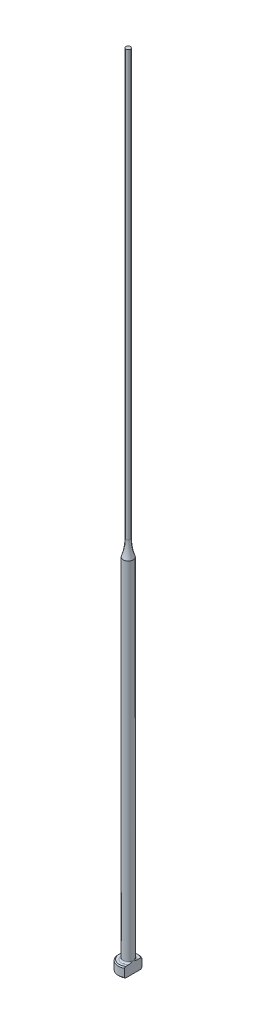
ISO-10303-21;
HEADER;
FILE_DESCRIPTION(('STEP AP214'),'2;1');
FILE_NAME('part.step','',(''),(''),'','','');
FILE_SCHEMA(('AUTOMOTIVE_DESIGN { 1 0 10303 214 1 1 1 1 }'));
ENDSEC;
DATA;
#1=APPLICATION_CONTEXT('core data for automotive mechanical design processes');
#2=APPLICATION_PROTOCOL_DEFINITION('international standard','automotive_design',2000,#1);
#3=PRODUCT_CONTEXT('',#1,'mechanical');
#4=PRODUCT('Part','Part','',(#3));
#5=PRODUCT_RELATED_PRODUCT_CATEGORY('part','',(#4));
#6=PRODUCT_DEFINITION_FORMATION('','',#4);
#7=PRODUCT_DEFINITION_CONTEXT('part definition',#1,'design');
#8=PRODUCT_DEFINITION('design','',#6,#7);
#9=PRODUCT_DEFINITION_SHAPE('','',#8);
#10=(LENGTH_UNIT() NAMED_UNIT(*) SI_UNIT(.MILLI.,.METRE.));
#11=(NAMED_UNIT(*) PLANE_ANGLE_UNIT() SI_UNIT($,.RADIAN.));
#12=(NAMED_UNIT(*) SI_UNIT($,.STERADIAN.) SOLID_ANGLE_UNIT());
#13=UNCERTAINTY_MEASURE_WITH_UNIT(LENGTH_MEASURE(1.E-05),#10,'distance_accuracy_value','');
#14=(GEOMETRIC_REPRESENTATION_CONTEXT(3) GLOBAL_UNCERTAINTY_ASSIGNED_CONTEXT((#13)) GLOBAL_UNIT_ASSIGNED_CONTEXT((#10,
#11,#12)) REPRESENTATION_CONTEXT('',''));
#15=CARTESIAN_POINT('',(0.,0.,0.));
#16=DIRECTION('',(0.,0.,1.));
#17=DIRECTION('',(1.,0.,0.));
#18=AXIS2_PLACEMENT_3D('',#15,#16,#17);
#19=CARTESIAN_POINT('',(-1.99999999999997,2.,0.));
#20=DIRECTION('',(0.,1.,0.));
#21=DIRECTION('',(0.,0.,1.));
#22=AXIS2_PLACEMENT_3D('',#19,#20,#21);
#23=PLANE('',#22);
#24=CARTESIAN_POINT('',(0.,2.,0.));
#25=DIRECTION('',(0.,1.,0.));
#26=DIRECTION('',(0.,0.,1.));
#27=AXIS2_PLACEMENT_3D('',#24,#25,#26);
#28=CIRCLE('',#27,1.79999999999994);
#29=CARTESIAN_POINT('',(0.999999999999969,2.,-1.49666295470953));
#30=VERTEX_POINT('',#29);
#31=CARTESIAN_POINT('',(0.999999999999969,2.,1.49666295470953));
#32=VERTEX_POINT('',#31);
#33=EDGE_CURVE('E187',#30,#32,#28,.T.);
#34=ORIENTED_EDGE('',*,*,#33,.T.);
#35=DIRECTION('',(0.,0.,-1.));
#36=VECTOR('',#35,1.);
#37=CARTESIAN_POINT('',(0.999999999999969,2.,0.));
#38=LINE('',#37,#36);
#39=CARTESIAN_POINT('',(0.999999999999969,2.00000000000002,0.830662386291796));
#40=VERTEX_POINT('',#39);
#41=EDGE_CURVE('E57',#32,#40,#38,.T.);
#42=ORIENTED_EDGE('',*,*,#41,.T.);
#43=CARTESIAN_POINT('',(0.,2.,0.));
#44=DIRECTION('',(0.,1.,0.));
#45=DIRECTION('',(0.,0.,1.));
#46=AXIS2_PLACEMENT_3D('',#43,#44,#45);
#47=CIRCLE('',#46,1.29999999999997);
#48=CARTESIAN_POINT('',(0.999999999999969,2.00000000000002,-0.830662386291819));
#49=VERTEX_POINT('',#48);
#50=EDGE_CURVE('E108',#40,#49,#47,.F.);
#51=ORIENTED_EDGE('',*,*,#50,.T.);
#52=EDGE_CURVE('E137',#49,#30,#38,.T.);
#53=ORIENTED_EDGE('',*,*,#52,.T.);
#54=EDGE_LOOP('',(#34,#42,#51,#53));
#55=FACE_BOUND('',#54,.T.);
#56=ADVANCED_FACE('F32',(#55),#23,.T.);
#57=CARTESIAN_POINT('',(0.,259.958771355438,0.));
#58=DIRECTION('',(0.,1.,0.));
#59=DIRECTION('',(0.,0.,1.));
#60=AXIS2_PLACEMENT_3D('',#57,#58,#59);
#61=CYLINDRICAL_SURFACE('',#60,1.99999999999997);
#62=CARTESIAN_POINT('',(0.,1.79999999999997,0.));
#63=DIRECTION('',(0.,1.,0.));
#64=DIRECTION('',(0.,0.,1.));
#65=AXIS2_PLACEMENT_3D('',#62,#63,#64);
#66=CIRCLE('',#65,1.99999999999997);
#67=CARTESIAN_POINT('',(0.999999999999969,1.79999999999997,1.73205080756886));
#68=VERTEX_POINT('',#67);
#69=CARTESIAN_POINT('',(0.999999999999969,1.79999999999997,-1.73205080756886));
#70=VERTEX_POINT('',#69);
#71=EDGE_CURVE('E105',#68,#70,#66,.F.);
#72=ORIENTED_EDGE('',*,*,#71,.T.);
#73=DIRECTION('',(0.,-1.,0.));
#74=VECTOR('',#73,1.);
#75=CARTESIAN_POINT('',(0.999999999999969,160.,-1.73205080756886));
#76=LINE('',#75,#74);
#77=CARTESIAN_POINT('',(0.999999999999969,0.199999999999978,-1.73205080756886));
#78=VERTEX_POINT('',#77);
#79=EDGE_CURVE('E193',#70,#78,#76,.T.);
#80=ORIENTED_EDGE('',*,*,#79,.T.);
#81=CARTESIAN_POINT('',(0.,0.199999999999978,0.));
#82=DIRECTION('',(0.,-1.,0.));
#83=DIRECTION('',(0.,0.,-1.));
#84=AXIS2_PLACEMENT_3D('',#81,#82,#83);
#85=CIRCLE('',#84,1.99999999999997);
#86=CARTESIAN_POINT('',(0.999999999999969,0.199999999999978,1.73205080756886));
#87=VERTEX_POINT('',#86);
#88=EDGE_CURVE('E100',#78,#87,#85,.F.);
#89=ORIENTED_EDGE('',*,*,#88,.T.);
#90=DIRECTION('',(0.,-1.,0.));
#91=VECTOR('',#90,1.);
#92=CARTESIAN_POINT('',(0.999999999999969,160.,1.73205080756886));
#93=LINE('',#92,#91);
#94=EDGE_CURVE('E93',#68,#87,#93,.T.);
#95=ORIENTED_EDGE('',*,*,#94,.F.);
#96=EDGE_LOOP('',(#72,#80,#89,#95));
#97=FACE_BOUND('',#96,.T.);
#98=ADVANCED_FACE('F158',(#97),#61,.T.);
#99=CARTESIAN_POINT('',(0.,0.,0.));
#100=DIRECTION('',(0.,-1.,0.));
#101=DIRECTION('',(0.,0.,-1.));
#102=AXIS2_PLACEMENT_3D('',#99,#100,#101);
#103=PLANE('',#102);
#104=CARTESIAN_POINT('',(0.,0.,0.));
#105=DIRECTION('',(0.,-1.,0.));
#106=DIRECTION('',(0.,0.,-1.));
#107=AXIS2_PLACEMENT_3D('',#104,#105,#106);
#108=CIRCLE('',#107,1.79999999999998);
#109=CARTESIAN_POINT('',(0.999999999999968,0.,1.49666295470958));
#110=VERTEX_POINT('',#109);
#111=CARTESIAN_POINT('',(0.999999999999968,0.,-1.49666295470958));
#112=VERTEX_POINT('',#111);
#113=EDGE_CURVE('E98',#110,#112,#108,.T.);
#114=ORIENTED_EDGE('',*,*,#113,.T.);
#115=DIRECTION('',(0.,0.,1.));
#116=VECTOR('',#115,1.);
#117=CARTESIAN_POINT('',(0.999999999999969,0.,-1.73205080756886));
#118=LINE('',#117,#116);
#119=EDGE_CURVE('E83',#112,#110,#118,.T.);
#120=ORIENTED_EDGE('',*,*,#119,.T.);
#121=EDGE_LOOP('',(#114,#120));
#122=FACE_BOUND('',#121,.T.);
#123=ADVANCED_FACE('F103',(#122),#103,.T.);
#124=CARTESIAN_POINT('',(0.,2.,0.));
#125=DIRECTION('',(0.,-1.,0.));
#126=DIRECTION('',(0.,0.,-1.));
#127=AXIS2_PLACEMENT_3D('',#124,#125,#126);
#128=CONICAL_SURFACE('',#127,1.79999999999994,0.785398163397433);
#129=ORIENTED_EDGE('',*,*,#71,.F.);
#130=CARTESIAN_POINT('',(0.999999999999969,-0.143084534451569,3.81417299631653));
#131=CARTESIAN_POINT('',(0.999999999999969,-0.0593997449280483,3.72765647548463));
#132=CARTESIAN_POINT('',(0.999999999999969,0.0241940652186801,3.64105173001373));
#133=CARTESIAN_POINT('',(0.999999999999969,0.191148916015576,3.46761616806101));
#134=CARTESIAN_POINT('',(0.999999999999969,0.274509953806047,3.3807853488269));
#135=CARTESIAN_POINT('',(0.999999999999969,0.524249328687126,3.11979400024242));
#136=CARTESIAN_POINT('',(0.999999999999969,0.690198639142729,2.94522254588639));
#137=CARTESIAN_POINT('',(0.999999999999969,1.01697550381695,2.59782670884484));
#138=CARTESIAN_POINT('',(0.999999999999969,1.17783928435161,2.42503661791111));
#139=CARTESIAN_POINT('',(0.999999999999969,1.41669118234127,2.16364984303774));
#140=CARTESIAN_POINT('',(0.999999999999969,1.49589273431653,2.07616357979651));
#141=CARTESIAN_POINT('',(0.999999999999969,1.65313803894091,1.90015721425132));
#142=CARTESIAN_POINT('',(0.999999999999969,1.73118183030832,1.81163714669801));
#143=CARTESIAN_POINT('',(0.999999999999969,1.85567318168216,1.66767927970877));
#144=CARTESIAN_POINT('',(0.999999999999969,1.90265415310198,1.61270332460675));
#145=CARTESIAN_POINT('',(0.999999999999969,1.99577882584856,1.50203557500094));
#146=CARTESIAN_POINT('',(0.999999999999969,2.04192244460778,1.44634371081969));
#147=CARTESIAN_POINT('',(0.999999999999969,2.13356596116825,1.33345480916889));
#148=CARTESIAN_POINT('',(0.999999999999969,2.17905399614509,1.2762481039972));
#149=CARTESIAN_POINT('',(0.999999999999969,2.26844283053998,1.16060976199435));
#150=CARTESIAN_POINT('',(0.999999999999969,2.3123437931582,1.10217825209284));
#151=CARTESIAN_POINT('',(0.999999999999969,2.39853453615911,0.982773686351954));
#152=CARTESIAN_POINT('',(0.999999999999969,2.44078986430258,0.921775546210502));
#153=CARTESIAN_POINT('',(0.999999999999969,2.52187810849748,0.797387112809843));
#154=CARTESIAN_POINT('',(0.999999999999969,2.56070631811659,0.733993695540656));
#155=CARTESIAN_POINT('',(0.999999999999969,2.6324859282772,0.604932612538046));
#156=CARTESIAN_POINT('',(0.999999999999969,2.66550424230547,0.539302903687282));
#157=CARTESIAN_POINT('',(0.999999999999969,2.72301550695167,0.404437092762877));
#158=CARTESIAN_POINT('',(0.999999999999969,2.74753707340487,0.335214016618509));
#159=CARTESIAN_POINT('',(0.999999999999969,2.77407110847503,0.231400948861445));
#160=CARTESIAN_POINT('',(0.999999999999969,2.78110742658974,0.198093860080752));
#161=CARTESIAN_POINT('',(0.999999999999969,2.79200506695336,0.130954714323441));
#162=CARTESIAN_POINT('',(0.999999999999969,2.7958666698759,0.0971227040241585));
#163=CARTESIAN_POINT('',(0.999999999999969,2.80013905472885,0.0293410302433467));
#164=CARTESIAN_POINT('',(0.999999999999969,2.80056046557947,-0.00460794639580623));
#165=CARTESIAN_POINT('',(0.999999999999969,2.79795882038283,-0.0723663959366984));
#166=CARTESIAN_POINT('',(0.999999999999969,2.79493547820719,-0.106175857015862));
#167=CARTESIAN_POINT('',(0.999999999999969,2.78105481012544,-0.206326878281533));
#168=CARTESIAN_POINT('',(0.999999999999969,2.76542146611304,-0.272037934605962));
#169=CARTESIAN_POINT('',(0.999999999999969,2.73477554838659,-0.368312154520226));
#170=CARTESIAN_POINT('',(0.999999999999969,2.72331063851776,-0.40012349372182));
#171=CARTESIAN_POINT('',(0.999999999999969,2.69840546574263,-0.46296441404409));
#172=CARTESIAN_POINT('',(0.999999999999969,2.68496560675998,-0.493994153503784));
#173=CARTESIAN_POINT('',(0.999999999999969,2.64209309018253,-0.586298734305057));
#174=CARTESIAN_POINT('',(0.999999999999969,2.61022871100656,-0.64643570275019));
#175=CARTESIAN_POINT('',(0.999999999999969,2.5422853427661,-0.764304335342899));
#176=CARTESIAN_POINT('',(0.999999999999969,2.50620119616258,-0.822032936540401));
#177=CARTESIAN_POINT('',(0.999999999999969,2.43107084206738,-0.935840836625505));
#178=CARTESIAN_POINT('',(0.999999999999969,2.39201347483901,-0.991912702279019));
#179=CARTESIAN_POINT('',(0.999999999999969,2.31195870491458,-1.10259849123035));
#180=CARTESIAN_POINT('',(0.999999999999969,2.27096226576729,-1.15721311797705));
#181=CARTESIAN_POINT('',(0.999999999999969,2.18701695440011,-1.26606869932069));
#182=CARTESIAN_POINT('',(0.999999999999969,2.14404946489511,-1.32029522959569));
#183=CARTESIAN_POINT('',(0.999999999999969,2.0570505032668,-1.4278898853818));
#184=CARTESIAN_POINT('',(0.999999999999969,2.01301896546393,-1.48125795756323));
#185=CARTESIAN_POINT('',(0.999999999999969,1.87995068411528,-1.64010952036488));
#186=CARTESIAN_POINT('',(0.999999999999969,1.78973357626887,-1.74460261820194));
#187=CARTESIAN_POINT('',(0.999999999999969,1.62290341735,-1.93426834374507));
#188=CARTESIAN_POINT('',(0.999999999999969,1.54658658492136,-2.01970404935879));
#189=CARTESIAN_POINT('',(0.999999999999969,1.39301250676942,-2.18973019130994));
#190=CARTESIAN_POINT('',(0.999999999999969,1.31575523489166,-2.27432060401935));
#191=CARTESIAN_POINT('',(0.999999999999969,1.08283440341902,-2.52732479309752));
#192=CARTESIAN_POINT('',(0.999999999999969,0.926165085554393,-2.69481086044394));
#193=CARTESIAN_POINT('',(0.999999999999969,0.617772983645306,-3.02147252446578));
#194=CARTESIAN_POINT('',(0.999999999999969,0.466111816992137,-3.18070657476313));
#195=CARTESIAN_POINT('',(0.999999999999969,0.238015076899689,-3.41880818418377));
#196=CARTESIAN_POINT('',(0.999999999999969,0.1619245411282,-3.49800657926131));
#197=CARTESIAN_POINT('',(0.999999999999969,0.00955322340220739,-3.65621892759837));
#198=CARTESIAN_POINT('',(0.999999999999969,-0.0667275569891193,-3.73523288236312));
#199=CARTESIAN_POINT('',(0.999999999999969,-0.14308453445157,-3.81417299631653));
#200=B_SPLINE_CURVE_WITH_KNOTS('',3,(#130,#131,#132,#133,#134,#135,#136,#137,#138,#139,#140,
#141,#142,#143,#144,#145,#146,#147,#148,#149,#150,#151,#152,#153,#154,#155,#156,#157,#158,#159,
#160,#161,#162,#163,#164,#165,#166,#167,#168,#169,#170,#171,#172,#173,#174,#175,#176,#177,#178,
#179,#180,#181,#182,#183,#184,#185,#186,#187,#188,#189,#190,#191,#192,#193,#194,#195,#196,#197,
#198,#199),.UNSPECIFIED.,.F.,.F.,(4,2,2,2,2,2,2,2,2,2,2,2,2,2,2,2,2,2,2,2,2,2,2,2,2,2,2,2,2,2,2,
2,2,2,4),(0.,0.36110162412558,0.722207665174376,1.44478731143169,2.15299784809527,
2.5070263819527,2.8610430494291,3.07798416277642,3.29494655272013,3.51418925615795,
3.73340935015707,3.95594813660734,4.17878792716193,4.39886399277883,4.61819150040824,
4.72018864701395,4.82217677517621,4.92384967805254,5.02553102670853,5.22698459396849,
5.32838854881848,5.4297717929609,5.63365200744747,5.837784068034,6.04272417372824,
6.24756349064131,6.45510395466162,6.66265726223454,7.07676259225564,7.42043039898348,
7.76410778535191,8.45210822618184,9.11180822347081,9.44129145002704,9.77077197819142),.UNSPECIFIED.);
#201=EDGE_CURVE('E136',#68,#32,#200,.T.);
#202=ORIENTED_EDGE('',*,*,#201,.T.);
#203=ORIENTED_EDGE('',*,*,#33,.F.);
#204=EDGE_CURVE('E128',#30,#70,#200,.T.);
#205=ORIENTED_EDGE('',*,*,#204,.T.);
#206=EDGE_LOOP('',(#129,#202,#203,#205));
#207=FACE_BOUND('',#206,.T.);
#208=ADVANCED_FACE('F144',(#207),#128,.T.);
#209=CARTESIAN_POINT('',(0.,0.199999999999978,0.));
#210=DIRECTION('',(0.,1.,0.));
#211=DIRECTION('',(0.,0.,1.));
#212=AXIS2_PLACEMENT_3D('',#209,#210,#211);
#213=CONICAL_SURFACE('',#212,1.99999999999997,0.785398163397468);
#214=ORIENTED_EDGE('',*,*,#88,.F.);
#215=CARTESIAN_POINT('',(0.999999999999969,2.14308453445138,-3.81417299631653));
#216=CARTESIAN_POINT('',(0.999999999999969,2.05939974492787,-3.72765647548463));
#217=CARTESIAN_POINT('',(0.999999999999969,1.97580593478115,-3.64105173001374));
#218=CARTESIAN_POINT('',(0.999999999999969,1.80885108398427,-3.46761616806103));
#219=CARTESIAN_POINT('',(0.999999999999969,1.72549004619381,-3.38078534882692));
#220=CARTESIAN_POINT('',(0.999999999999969,1.47575067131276,-3.11979400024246));
#221=CARTESIAN_POINT('',(0.999999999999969,1.30980136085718,-2.94522254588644));
#222=CARTESIAN_POINT('',(0.999999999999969,0.983024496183,-2.5978267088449));
#223=CARTESIAN_POINT('',(0.999999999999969,0.822160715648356,-2.42503661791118));
#224=CARTESIAN_POINT('',(0.999999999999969,0.583308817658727,-2.16364984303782));
#225=CARTESIAN_POINT('',(0.999999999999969,0.50410726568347,-2.0761635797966));
#226=CARTESIAN_POINT('',(0.999999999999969,0.346861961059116,-1.90015721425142));
#227=CARTESIAN_POINT('',(0.999999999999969,0.26881816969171,-1.81163714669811));
#228=CARTESIAN_POINT('',(0.999999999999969,0.144326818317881,-1.66767927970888));
#229=CARTESIAN_POINT('',(0.999999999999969,0.0973458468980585,-1.61270332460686));
#230=CARTESIAN_POINT('',(0.999999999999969,0.00422117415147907,-1.50203557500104));
#231=CARTESIAN_POINT('',(0.999999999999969,-0.0419224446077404,-1.44634371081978));
#232=CARTESIAN_POINT('',(0.999999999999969,-0.133565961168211,-1.33345480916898));
#233=CARTESIAN_POINT('',(0.999999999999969,-0.179053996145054,-1.27624810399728));
#234=CARTESIAN_POINT('',(0.999999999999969,-0.268442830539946,-1.16060976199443));
#235=CARTESIAN_POINT('',(0.999999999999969,-0.31234379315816,-1.10217825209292));
#236=CARTESIAN_POINT('',(0.999999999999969,-0.398534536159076,-0.982773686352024));
#237=CARTESIAN_POINT('',(0.999999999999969,-0.440789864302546,-0.92177554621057));
#238=CARTESIAN_POINT('',(0.999999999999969,-0.521878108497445,-0.797387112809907));
#239=CARTESIAN_POINT('',(0.999999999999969,-0.560706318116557,-0.733993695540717));
#240=CARTESIAN_POINT('',(0.999999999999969,-0.632485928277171,-0.604932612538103));
#241=CARTESIAN_POINT('',(0.999999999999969,-0.665504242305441,-0.539302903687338));
#242=CARTESIAN_POINT('',(0.999999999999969,-0.723015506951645,-0.404437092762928));
#243=CARTESIAN_POINT('',(0.999999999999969,-0.747537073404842,-0.335214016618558));
#244=CARTESIAN_POINT('',(0.999999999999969,-0.774071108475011,-0.231400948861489));
#245=CARTESIAN_POINT('',(0.999999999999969,-0.781107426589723,-0.198093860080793));
#246=CARTESIAN_POINT('',(0.999999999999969,-0.792005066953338,-0.130954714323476));
#247=CARTESIAN_POINT('',(0.999999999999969,-0.795866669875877,-0.0971227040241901));
#248=CARTESIAN_POINT('',(0.999999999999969,-0.800139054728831,-0.0293410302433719));
#249=CARTESIAN_POINT('',(0.999999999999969,-0.80056046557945,0.00460794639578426));
#250=CARTESIAN_POINT('',(0.999999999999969,-0.797958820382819,0.0723663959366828));
#251=CARTESIAN_POINT('',(0.999999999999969,-0.794935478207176,0.106175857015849));
#252=CARTESIAN_POINT('',(0.999999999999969,-0.781054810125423,0.20632687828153));
#253=CARTESIAN_POINT('',(0.999999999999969,-0.765421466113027,0.272037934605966));
#254=CARTESIAN_POINT('',(0.999999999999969,-0.734775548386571,0.36831215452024));
#255=CARTESIAN_POINT('',(0.999999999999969,-0.723310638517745,0.400123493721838));
#256=CARTESIAN_POINT('',(0.999999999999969,-0.698405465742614,0.462964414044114));
#257=CARTESIAN_POINT('',(0.999999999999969,-0.684965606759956,0.493994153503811));
#258=CARTESIAN_POINT('',(0.999999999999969,-0.642093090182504,0.586298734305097));
#259=CARTESIAN_POINT('',(0.999999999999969,-0.610228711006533,0.646435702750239));
#260=CARTESIAN_POINT('',(0.999999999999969,-0.542285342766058,0.764304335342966));
#261=CARTESIAN_POINT('',(0.999999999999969,-0.506201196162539,0.822032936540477));
#262=CARTESIAN_POINT('',(0.999999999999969,-0.431070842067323,0.935840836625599));
#263=CARTESIAN_POINT('',(0.999999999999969,-0.392013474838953,0.991912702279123));
#264=CARTESIAN_POINT('',(0.999999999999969,-0.311958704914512,1.10259849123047));
#265=CARTESIAN_POINT('',(0.999999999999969,-0.270962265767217,1.15721311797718));
#266=CARTESIAN_POINT('',(0.999999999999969,-0.187016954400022,1.26606869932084));
#267=CARTESIAN_POINT('',(0.999999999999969,-0.144049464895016,1.32029522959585));
#268=CARTESIAN_POINT('',(0.999999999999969,-0.0570505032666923,1.42788988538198));
#269=CARTESIAN_POINT('',(0.999999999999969,-0.0130189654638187,1.48125795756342));
#270=CARTESIAN_POINT('',(0.999999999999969,0.120049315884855,1.64010952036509));
#271=CARTESIAN_POINT('',(0.999999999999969,0.21026642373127,1.74460261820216));
#272=CARTESIAN_POINT('',(0.999999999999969,0.37709658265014,1.9342683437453));
#273=CARTESIAN_POINT('',(0.999999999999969,0.453413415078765,2.01970404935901));
#274=CARTESIAN_POINT('',(0.999999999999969,0.606987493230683,2.18973019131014));
#275=CARTESIAN_POINT('',(0.999999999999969,0.684244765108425,2.27432060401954));
#276=CARTESIAN_POINT('',(0.999999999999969,0.917165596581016,2.52732479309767));
#277=CARTESIAN_POINT('',(0.999999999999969,1.07383491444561,2.69481086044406));
#278=CARTESIAN_POINT('',(0.999999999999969,1.38222701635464,3.02147252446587));
#279=CARTESIAN_POINT('',(0.999999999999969,1.53388818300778,3.1807065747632));
#280=CARTESIAN_POINT('',(0.999999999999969,1.76198492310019,3.41880818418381));
#281=CARTESIAN_POINT('',(0.999999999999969,1.83807545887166,3.49800657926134));
#282=CARTESIAN_POINT('',(0.999999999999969,1.99044677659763,3.65621892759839));
#283=CARTESIAN_POINT('',(0.999999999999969,2.06672755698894,3.73523288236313));
#284=CARTESIAN_POINT('',(0.999999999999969,2.14308453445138,3.81417299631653));
#285=B_SPLINE_CURVE_WITH_KNOTS('',3,(#215,#216,#217,#218,#219,#220,#221,#222,#223,#224,#225,
#226,#227,#228,#229,#230,#231,#232,#233,#234,#235,#236,#237,#238,#239,#240,#241,#242,#243,#244,
#245,#246,#247,#248,#249,#250,#251,#252,#253,#254,#255,#256,#257,#258,#259,#260,#261,#262,#263,
#264,#265,#266,#267,#268,#269,#270,#271,#272,#273,#274,#275,#276,#277,#278,#279,#280,#281,#282,
#283,#284),.UNSPECIFIED.,.F.,.F.,(4,2,2,2,2,2,2,2,2,2,2,2,2,2,2,2,2,2,2,2,2,2,2,2,2,2,2,2,2,2,2,
2,2,2,4),(0.,0.36110162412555,0.722207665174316,1.44478731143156,2.15299784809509,
2.5070263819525,2.86104304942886,3.07798416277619,3.2949465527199,3.51418925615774,
3.73340935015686,3.95594813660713,4.17878792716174,4.39886399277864,4.61819150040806,
4.72018864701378,4.82217677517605,4.92384967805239,5.02553102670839,5.22698459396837,
5.32838854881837,5.4297717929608,5.6336520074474,5.83778406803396,6.04272417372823,
6.24756349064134,6.45510395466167,6.66265726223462,7.07676259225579,7.42043039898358,
7.76410778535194,8.45210822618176,9.11180822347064,9.44129145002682,9.77077197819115),.UNSPECIFIED.);
#286=EDGE_CURVE('E86',#78,#112,#285,.T.);
#287=ORIENTED_EDGE('',*,*,#286,.T.);
#288=ORIENTED_EDGE('',*,*,#113,.F.);
#289=EDGE_CURVE('E89',#110,#87,#285,.T.);
#290=ORIENTED_EDGE('',*,*,#289,.T.);
#291=EDGE_LOOP('',(#214,#287,#288,#290));
#292=FACE_BOUND('',#291,.T.);
#293=ADVANCED_FACE('F97',(#292),#213,.T.);
#294=CARTESIAN_POINT('',(0.,2.30000000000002,0.));
#295=DIRECTION('',(0.,1.,0.));
#296=DIRECTION('',(0.,0.,1.));
#297=AXIS2_PLACEMENT_3D('',#294,#295,#296);
#298=TOROIDAL_SURFACE('',#297,1.29999999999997,0.3);
#299=CARTESIAN_POINT('',(0.999999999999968,2.30000000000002,0.));
#300=CARTESIAN_POINT('',(0.999999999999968,2.30000064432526,8.6574445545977E-12));
#301=CARTESIAN_POINT('',(0.999999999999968,2.30000128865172,-9.05742231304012E-08));
#302=CARTESIAN_POINT('',(0.999999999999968,2.30000254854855,-3.98319620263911E-07));
#303=CARTESIAN_POINT('',(0.999999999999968,2.30000316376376,-6.16748313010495E-07));
#304=CARTESIAN_POINT('',(0.999999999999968,2.30000438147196,-1.15047367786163E-06));
#305=CARTESIAN_POINT('',(0.999999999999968,2.30000498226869,-1.46954564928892E-06));
#306=CARTESIAN_POINT('',(0.999999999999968,2.30000613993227,-2.17388585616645E-06));
#307=CARTESIAN_POINT('',(0.999999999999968,2.3000066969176,-2.55896592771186E-06));
#308=CARTESIAN_POINT('',(0.999999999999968,2.30000847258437,-3.89137454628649E-06));
#309=CARTESIAN_POINT('',(0.999999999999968,2.30000962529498,-4.9272569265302E-06));
#310=CARTESIAN_POINT('',(0.999999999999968,2.30001175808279,-7.12255376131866E-06));
#311=CARTESIAN_POINT('',(0.999999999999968,2.30001274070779,-8.27963246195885E-06));
#312=CARTESIAN_POINT('',(0.999999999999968,2.30001619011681,-1.25710396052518E-05));
#313=CARTESIAN_POINT('',(0.999999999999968,2.30001847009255,-1.58589994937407E-05));
#314=CARTESIAN_POINT('',(0.999999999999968,2.3000224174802,-2.25210462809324E-05));
#315=CARTESIAN_POINT('',(0.999999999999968,2.30002411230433,-2.58796667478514E-05));
#316=CARTESIAN_POINT('',(0.999999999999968,2.30003085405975,-3.94941957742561E-05));
#317=CARTESIAN_POINT('',(0.999999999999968,2.30003568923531,-4.98493079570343E-05));
#318=CARTESIAN_POINT('',(0.999999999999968,2.30004388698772,-6.96407730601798E-05));
#319=CARTESIAN_POINT('',(0.999999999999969,2.30004735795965,-7.903098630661E-05));
#320=CARTESIAN_POINT('',(0.999999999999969,2.30007348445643,-0.000144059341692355));
#321=CARTESIAN_POINT('',(0.999999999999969,2.30010510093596,-0.000195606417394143));
#322=CARTESIAN_POINT('',(0.999999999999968,2.30022061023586,-0.000391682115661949));
#323=CARTESIAN_POINT('',(0.999999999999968,2.3002978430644,-0.000539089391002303));
#324=CARTESIAN_POINT('',(0.999999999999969,2.30059433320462,-0.00109591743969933));
#325=CARTESIAN_POINT('',(0.999999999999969,2.30082052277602,-0.00150237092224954));
#326=CARTESIAN_POINT('',(0.999999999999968,2.30171558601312,-0.00311941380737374));
#327=CARTESIAN_POINT('',(0.999999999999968,2.30237677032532,-0.00433326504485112));
#328=CARTESIAN_POINT('',(0.999999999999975,2.31602135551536,-0.0293725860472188));
#329=CARTESIAN_POINT('',(0.99999999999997,2.32909104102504,-0.0531623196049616));
#330=CARTESIAN_POINT('',(0.999999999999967,2.35458080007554,-0.100088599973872));
#331=CARTESIAN_POINT('',(0.999999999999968,2.36700820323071,-0.123221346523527));
#332=CARTESIAN_POINT('',(0.999999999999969,2.39281545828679,-0.172044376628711));
#333=CARTESIAN_POINT('',(0.999999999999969,2.4061616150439,-0.197752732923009));
#334=CARTESIAN_POINT('',(0.999999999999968,2.4323541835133,-0.249714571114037));
#335=CARTESIAN_POINT('',(0.999999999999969,2.44519503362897,-0.27597087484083));
#336=CARTESIAN_POINT('',(0.999999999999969,2.46718175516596,-0.322864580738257));
#337=CARTESIAN_POINT('',(0.999999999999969,2.47650292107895,-0.34341923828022));
#338=CARTESIAN_POINT('',(0.999999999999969,2.49448113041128,-0.384761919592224));
#339=CARTESIAN_POINT('',(0.999999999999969,2.50313958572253,-0.405549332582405));
#340=CARTESIAN_POINT('',(0.999999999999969,2.5276434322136,-0.467585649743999));
#341=CARTESIAN_POINT('',(0.999999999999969,2.54239224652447,-0.509286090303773));
#342=CARTESIAN_POINT('',(0.999999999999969,2.56458900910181,-0.58349816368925));
#343=CARTESIAN_POINT('',(0.999999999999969,2.57294045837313,-0.61573699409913));
#344=CARTESIAN_POINT('',(0.999999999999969,2.58691787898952,-0.682155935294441));
#345=CARTESIAN_POINT('',(0.999999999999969,2.5924232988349,-0.716362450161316));
#346=CARTESIAN_POINT('',(0.999999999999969,2.59932200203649,-0.784996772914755));
#347=CARTESIAN_POINT('',(0.999999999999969,2.60074119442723,-0.819421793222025));
#348=CARTESIAN_POINT('',(0.999999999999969,2.59853032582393,-0.88779225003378));
#349=CARTESIAN_POINT('',(0.999999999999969,2.59495737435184,-0.921738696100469));
#350=CARTESIAN_POINT('',(0.999999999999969,2.58381038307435,-0.977927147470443));
#351=CARTESIAN_POINT('',(0.999999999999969,2.57785171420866,-1.00048693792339));
#352=CARTESIAN_POINT('',(0.999999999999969,2.56267132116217,-1.0445512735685));
#353=CARTESIAN_POINT('',(0.999999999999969,2.55344592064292,-1.06605459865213));
#354=CARTESIAN_POINT('',(0.999999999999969,2.53348156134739,-1.10327564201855));
#355=CARTESIAN_POINT('',(0.999999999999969,2.52335553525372,-1.11931996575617));
#356=CARTESIAN_POINT('',(0.999999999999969,2.50063930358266,-1.1495565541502));
#357=CARTESIAN_POINT('',(0.999999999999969,2.48805327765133,-1.16375189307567));
#358=CARTESIAN_POINT('',(0.999999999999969,2.46313284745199,-1.18709127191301));
#359=CARTESIAN_POINT('',(0.999999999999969,2.45121755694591,-1.19668155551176));
#360=CARTESIAN_POINT('',(0.999999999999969,2.4259612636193,-1.21377371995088));
#361=CARTESIAN_POINT('',(0.999999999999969,2.41262072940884,-1.2212762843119));
#362=CARTESIAN_POINT('',(0.999999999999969,2.38471163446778,-1.23381879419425));
#363=CARTESIAN_POINT('',(0.999999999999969,2.3701356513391,-1.23884240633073));
#364=CARTESIAN_POINT('',(0.999999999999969,2.34029120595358,-1.2460136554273));
#365=CARTESIAN_POINT('',(0.999999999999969,2.32502317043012,-1.24816304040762));
#366=CARTESIAN_POINT('',(0.999999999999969,2.29609418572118,-1.24936303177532));
#367=CARTESIAN_POINT('',(0.999999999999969,2.28244572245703,-1.24873511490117));
#368=CARTESIAN_POINT('',(0.999999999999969,2.25546467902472,-1.24513625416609));
#369=CARTESIAN_POINT('',(0.999999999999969,2.2421320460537,-1.24216570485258));
#370=CARTESIAN_POINT('',(0.999999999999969,2.21644742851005,-1.23414136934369));
#371=CARTESIAN_POINT('',(0.999999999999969,2.20408009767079,-1.22913614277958));
#372=CARTESIAN_POINT('',(0.999999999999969,2.18026539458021,-1.2172891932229));
#373=CARTESIAN_POINT('',(0.999999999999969,2.16881815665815,-1.21044720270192));
#374=CARTESIAN_POINT('',(0.999999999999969,2.14602713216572,-1.19450929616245));
#375=CARTESIAN_POINT('',(0.999999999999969,2.1347876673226,-1.18526487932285));
#376=CARTESIAN_POINT('',(0.999999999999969,2.11372805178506,-1.16528066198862));
#377=CARTESIAN_POINT('',(0.999999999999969,2.1039092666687,-1.15453944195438));
#378=CARTESIAN_POINT('',(0.999999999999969,2.08131380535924,-1.12639326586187));
#379=CARTESIAN_POINT('',(0.999999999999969,2.06941227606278,-1.10828305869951));
#380=CARTESIAN_POINT('',(0.999999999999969,2.04871157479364,-1.07041295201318));
#381=CARTESIAN_POINT('',(0.999999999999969,2.03991325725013,-1.05065259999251));
#382=CARTESIAN_POINT('',(0.999999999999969,2.02219264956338,-1.00203188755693));
#383=CARTESIAN_POINT('',(0.999999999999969,2.01461756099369,-0.972682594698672));
#384=CARTESIAN_POINT('',(0.999999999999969,2.00410660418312,-0.912914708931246));
#385=CARTESIAN_POINT('',(0.999999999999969,2.00122174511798,-0.882487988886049));
#386=CARTESIAN_POINT('',(0.999999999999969,1.99886242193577,-0.80318909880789));
#387=CARTESIAN_POINT('',(0.999999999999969,2.0024814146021,-0.754226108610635));
#388=CARTESIAN_POINT('',(0.999999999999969,2.01327071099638,-0.682724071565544));
#389=CARTESIAN_POINT('',(0.999999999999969,2.01762186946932,-0.659663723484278));
#390=CARTESIAN_POINT('',(0.999999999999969,2.02775671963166,-0.613959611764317));
#391=CARTESIAN_POINT('',(0.999999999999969,2.03353398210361,-0.59131445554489));
#392=CARTESIAN_POINT('',(0.999999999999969,2.05232003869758,-0.525222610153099));
#393=CARTESIAN_POINT('',(0.999999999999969,2.0670175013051,-0.482256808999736));
#394=CARTESIAN_POINT('',(0.999999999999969,2.09166172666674,-0.418361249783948));
#395=CARTESIAN_POINT('',(0.999999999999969,2.10040936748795,-0.396945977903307));
#396=CARTESIAN_POINT('',(0.999999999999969,2.11862724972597,-0.354367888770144));
#397=CARTESIAN_POINT('',(0.999999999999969,2.12809902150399,-0.33320572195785));
#398=CARTESIAN_POINT('',(0.999999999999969,2.15054796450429,-0.284809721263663));
#399=CARTESIAN_POINT('',(0.999999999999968,2.16372144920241,-0.257667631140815));
#400=CARTESIAN_POINT('',(0.999999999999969,2.19063957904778,-0.203972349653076));
#401=CARTESIAN_POINT('',(0.999999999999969,2.20437810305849,-0.177416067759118));
#402=CARTESIAN_POINT('',(0.999999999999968,2.23096755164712,-0.127000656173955));
#403=CARTESIAN_POINT('',(0.999999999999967,2.2437812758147,-0.103121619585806));
#404=CARTESIAN_POINT('',(0.99999999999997,2.27007504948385,-0.0546869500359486));
#405=CARTESIAN_POINT('',(0.999999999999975,2.28356304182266,-0.0301354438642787));
#406=CARTESIAN_POINT('',(0.999999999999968,2.29762327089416,-0.00433318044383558));
#407=CARTESIAN_POINT('',(0.999999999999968,2.29828450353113,-0.00311924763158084));
#408=CARTESIAN_POINT('',(0.999999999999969,2.29917957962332,-0.0015021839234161));
#409=CARTESIAN_POINT('',(0.999999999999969,2.2994057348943,-0.0010957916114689));
#410=CARTESIAN_POINT('',(0.999999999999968,2.29970218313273,-0.000539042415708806));
#411=CARTESIAN_POINT('',(0.999999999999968,2.29977940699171,-0.000391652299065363));
#412=CARTESIAN_POINT('',(0.999999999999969,2.29989490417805,-0.000195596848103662));
#413=CARTESIAN_POINT('',(0.999999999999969,2.2999265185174,-0.000144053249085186));
#414=CARTESIAN_POINT('',(0.999999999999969,2.29995264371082,-7.90290824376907E-05));
#415=CARTESIAN_POINT('',(0.999999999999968,2.29995611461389,-6.96391975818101E-05));
#416=CARTESIAN_POINT('',(0.999999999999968,2.29996431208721,-4.98484228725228E-05));
#417=CARTESIAN_POINT('',(0.999999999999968,2.29996914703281,-3.94936645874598E-05));
#418=CARTESIAN_POINT('',(0.999999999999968,2.29997588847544,-2.587953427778E-05));
#419=CARTESIAN_POINT('',(0.999999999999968,2.29997758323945,-2.25209724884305E-05));
#420=CARTESIAN_POINT('',(0.999999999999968,2.29998153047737,-1.58590310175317E-05));
#421=CARTESIAN_POINT('',(0.999999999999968,2.29998381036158,-1.25711163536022E-05));
#422=CARTESIAN_POINT('',(0.999999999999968,2.29998725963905,-8.27974911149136E-06));
#423=CARTESIAN_POINT('',(0.999999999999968,2.29998824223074,-7.122675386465E-06));
#424=CARTESIAN_POINT('',(0.999999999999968,2.29999037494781,-4.92738159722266E-06));
#425=CARTESIAN_POINT('',(0.999999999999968,2.29999152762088,-3.89149712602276E-06));
#426=CARTESIAN_POINT('',(0.999999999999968,2.29999330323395,-2.5590774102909E-06));
#427=CARTESIAN_POINT('',(0.999999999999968,2.29999386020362,-2.17399250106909E-06));
#428=CARTESIAN_POINT('',(0.999999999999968,2.29999501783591,-1.4696398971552E-06));
#429=CARTESIAN_POINT('',(0.999999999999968,2.299995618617,-1.15056035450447E-06));
#430=CARTESIAN_POINT('',(0.999999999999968,2.29999683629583,-6.16816558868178E-07));
#431=CARTESIAN_POINT('',(0.999999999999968,2.29999745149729,-3.98377208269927E-07));
#432=CARTESIAN_POINT('',(0.999999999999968,2.29999871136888,-9.06063088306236E-08));
#433=CARTESIAN_POINT('',(0.999999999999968,2.29999935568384,-8.657323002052E-12));
#434=CARTESIAN_POINT('',(0.999999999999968,2.30000000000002,0.));
#435=B_SPLINE_CURVE_WITH_KNOTS('',3,(#299,#300,#301,#302,#303,#304,#305,#306,#307,#308,#309,
#310,#311,#312,#313,#314,#315,#316,#317,#318,#319,#320,#321,#322,#323,#324,#325,#326,#327,#328,
#329,#330,#331,#332,#333,#334,#335,#336,#337,#338,#339,#340,#341,#342,#343,#344,#345,#346,#347,
#348,#349,#350,#351,#352,#353,#354,#355,#356,#357,#358,#359,#360,#361,#362,#363,#364,#365,#366,
#367,#368,#369,#370,#371,#372,#373,#374,#375,#376,#377,#378,#379,#380,#381,#382,#383,#384,#385,
#386,#387,#388,#389,#390,#391,#392,#393,#394,#395,#396,#397,#398,#399,#400,#401,#402,#403,#404,
#405,#406,#407,#408,#409,#410,#411,#412,#413,#414,#415,#416,#417,#418,#419,#420,#421,#422,#423,
#424,#425,#426,#427,#428,#429,#430,#431,#432,#433,#434),.UNSPECIFIED.,.T.,.F.,(4,2,2,2,2,2,2,2,
2,2,2,2,2,2,2,2,2,2,2,2,2,2,2,2,2,2,2,2,2,2,2,2,2,2,2,2,2,2,2,2,2,2,2,2,2,2,2,2,2,2,2,2,2,2,2,2,
2,2,2,2,2,2,2,2,2,2,2,4),(0.,1.93088000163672E-06,3.88121487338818E-06,5.91576027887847E-06,
7.94459959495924E-06,1.25713540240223E-05,1.71213138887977E-05,2.9075120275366E-05,
4.0350817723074E-05,7.46190414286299E-05,0.000104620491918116,0.00028499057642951,
0.000785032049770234,0.00217951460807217,0.00632720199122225,0.0877445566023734,
0.166524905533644,0.253417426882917,0.341089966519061,0.408787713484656,0.476336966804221,
0.608850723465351,0.708652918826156,0.812393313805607,0.915474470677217,1.01738599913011,
1.08718721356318,1.15706723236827,1.21377727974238,1.27039179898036,1.31609373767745,
1.36178069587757,1.40776478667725,1.4537208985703,1.49450576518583,1.5352837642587,
1.57514089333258,1.61500383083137,1.65849635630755,1.70203041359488,1.76667915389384,
1.83134568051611,1.92177629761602,2.0131839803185,2.15955153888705,2.22993031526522,
2.29999742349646,2.43600819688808,2.50540041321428,2.57494356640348,2.66544006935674,
2.75513178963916,2.83643278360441,2.92045687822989,2.92460484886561,2.92599912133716,
2.926499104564,2.92667946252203,2.92670946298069,2.92674372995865,2.92675500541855,
2.92676695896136,2.92677150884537,2.92677613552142,2.92677816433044,2.92678019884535,
2.92678214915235,2.92678408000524),.UNSPECIFIED.);
#436=CARTESIAN_POINT('',(0.999999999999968,2.30000000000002,0.));
#437=VERTEX_POINT('',#436);
#438=EDGE_CURVE('E11',#49,#437,#435,.T.);
#439=ORIENTED_EDGE('',*,*,#438,.F.);
#440=ORIENTED_EDGE('',*,*,#50,.F.);
#441=CARTESIAN_POINT('',(0.999999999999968,2.30000000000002,0.));
#442=CARTESIAN_POINT('',(0.999999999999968,2.29999935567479,-8.65741696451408E-12));
#443=CARTESIAN_POINT('',(0.999999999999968,2.29999871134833,9.05742231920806E-08));
#444=CARTESIAN_POINT('',(0.999999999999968,2.2999974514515,3.98319620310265E-07));
#445=CARTESIAN_POINT('',(0.999999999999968,2.29999683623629,6.16748313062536E-07));
#446=CARTESIAN_POINT('',(0.999999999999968,2.29999561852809,1.15047367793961E-06));
#447=CARTESIAN_POINT('',(0.999999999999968,2.29999501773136,1.46954564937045E-06));
#448=CARTESIAN_POINT('',(0.999999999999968,2.29999386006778,2.17388585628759E-06));
#449=CARTESIAN_POINT('',(0.999999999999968,2.29999330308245,2.55896592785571E-06));
#450=CARTESIAN_POINT('',(0.999999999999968,2.29999152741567,3.89137454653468E-06));
#451=CARTESIAN_POINT('',(0.999999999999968,2.29999037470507,4.92725692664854E-06));
#452=CARTESIAN_POINT('',(0.999999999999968,2.29998824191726,7.12255376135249E-06));
#453=CARTESIAN_POINT('',(0.999999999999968,2.29998725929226,8.27963246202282E-06));
#454=CARTESIAN_POINT('',(0.999999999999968,2.29998380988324,1.25710396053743E-05));
#455=CARTESIAN_POINT('',(0.999999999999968,2.2999815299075,1.58589994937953E-05));
#456=CARTESIAN_POINT('',(0.999999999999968,2.29997758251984,2.25210462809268E-05));
#457=CARTESIAN_POINT('',(0.999999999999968,2.29997588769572,2.58796667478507E-05));
#458=CARTESIAN_POINT('',(0.999999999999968,2.29996914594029,3.94941957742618E-05));
#459=CARTESIAN_POINT('',(0.999999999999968,2.29996431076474,4.98493079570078E-05));
#460=CARTESIAN_POINT('',(0.999999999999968,2.29995611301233,6.96407730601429E-05));
#461=CARTESIAN_POINT('',(0.999999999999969,2.2999526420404,7.90309863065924E-05));
#462=CARTESIAN_POINT('',(0.999999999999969,2.29992651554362,0.000144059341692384));
#463=CARTESIAN_POINT('',(0.999999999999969,2.29989489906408,0.000195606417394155));
#464=CARTESIAN_POINT('',(0.999999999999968,2.29977938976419,0.000391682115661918));
#465=CARTESIAN_POINT('',(0.999999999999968,2.29970215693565,0.000539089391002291));
#466=CARTESIAN_POINT('',(0.999999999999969,2.29940566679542,0.00109591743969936));
#467=CARTESIAN_POINT('',(0.999999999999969,2.29917947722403,0.00150237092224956));
#468=CARTESIAN_POINT('',(0.999999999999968,2.29828441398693,0.0031194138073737));
#469=CARTESIAN_POINT('',(0.999999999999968,2.29762322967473,0.0043332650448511));
#470=CARTESIAN_POINT('',(0.999999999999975,2.28397864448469,0.0293725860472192));
#471=CARTESIAN_POINT('',(0.99999999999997,2.27090895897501,0.0531623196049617));
#472=CARTESIAN_POINT('',(0.999999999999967,2.24541919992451,0.100088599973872));
#473=CARTESIAN_POINT('',(0.999999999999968,2.23299179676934,0.123221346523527));
#474=CARTESIAN_POINT('',(0.999999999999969,2.20718454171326,0.172044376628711));
#475=CARTESIAN_POINT('',(0.999999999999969,2.19383838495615,0.197752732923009));
#476=CARTESIAN_POINT('',(0.999999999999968,2.16764581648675,0.249714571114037));
#477=CARTESIAN_POINT('',(0.999999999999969,2.15480496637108,0.27597087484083));
#478=CARTESIAN_POINT('',(0.999999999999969,2.13281824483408,0.322864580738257));
#479=CARTESIAN_POINT('',(0.999999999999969,2.1234970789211,0.34341923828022));
#480=CARTESIAN_POINT('',(0.999999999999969,2.10551886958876,0.384761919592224));
#481=CARTESIAN_POINT('',(0.999999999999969,2.09686041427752,0.405549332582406));
#482=CARTESIAN_POINT('',(0.999999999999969,2.07235656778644,0.467585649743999));
#483=CARTESIAN_POINT('',(0.999999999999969,2.05760775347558,0.509286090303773));
#484=CARTESIAN_POINT('',(0.999999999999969,2.03541099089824,0.58349816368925));
#485=CARTESIAN_POINT('',(0.999999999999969,2.02705954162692,0.61573699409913));
#486=CARTESIAN_POINT('',(0.999999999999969,2.01308212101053,0.682155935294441));
#487=CARTESIAN_POINT('',(0.999999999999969,2.00757670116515,0.716362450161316));
#488=CARTESIAN_POINT('',(0.999999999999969,2.00067799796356,0.784996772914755));
#489=CARTESIAN_POINT('',(0.999999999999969,1.99925880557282,0.819421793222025));
#490=CARTESIAN_POINT('',(0.999999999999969,2.00146967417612,0.88779225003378));
#491=CARTESIAN_POINT('',(0.999999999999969,2.00504262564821,0.921738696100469));
#492=CARTESIAN_POINT('',(0.999999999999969,2.0161896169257,0.977927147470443));
#493=CARTESIAN_POINT('',(0.999999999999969,2.02214828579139,1.00048693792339));
#494=CARTESIAN_POINT('',(0.999999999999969,2.03732867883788,1.0445512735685));
#495=CARTESIAN_POINT('',(0.999999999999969,2.04655407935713,1.06605459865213));
#496=CARTESIAN_POINT('',(0.999999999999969,2.06651843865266,1.10327564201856));
#497=CARTESIAN_POINT('',(0.999999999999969,2.07664446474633,1.11931996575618));
#498=CARTESIAN_POINT('',(0.999999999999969,2.09936069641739,1.14955655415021));
#499=CARTESIAN_POINT('',(0.999999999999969,2.11194672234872,1.16375189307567));
#500=CARTESIAN_POINT('',(0.999999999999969,2.13686715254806,1.18709127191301));
#501=CARTESIAN_POINT('',(0.999999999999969,2.14878244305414,1.19668155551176));
#502=CARTESIAN_POINT('',(0.999999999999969,2.17403873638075,1.21377371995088));
#503=CARTESIAN_POINT('',(0.999999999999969,2.18737927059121,1.2212762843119));
#504=CARTESIAN_POINT('',(0.999999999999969,2.21528836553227,1.23381879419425));
#505=CARTESIAN_POINT('',(0.999999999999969,2.22986434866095,1.23884240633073));
#506=CARTESIAN_POINT('',(0.999999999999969,2.25970879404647,1.2460136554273));
#507=CARTESIAN_POINT('',(0.999999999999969,2.27497682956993,1.24816304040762));
#508=CARTESIAN_POINT('',(0.999999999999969,2.30390581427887,1.24936303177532));
#509=CARTESIAN_POINT('',(0.999999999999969,2.31755427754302,1.24873511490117));
#510=CARTESIAN_POINT('',(0.999999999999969,2.34453532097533,1.24513625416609));
#511=CARTESIAN_POINT('',(0.999999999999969,2.35786795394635,1.24216570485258));
#512=CARTESIAN_POINT('',(0.999999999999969,2.38355257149,1.23414136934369));
#513=CARTESIAN_POINT('',(0.999999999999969,2.39591990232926,1.22913614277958));
#514=CARTESIAN_POINT('',(0.999999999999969,2.41973460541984,1.2172891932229));
#515=CARTESIAN_POINT('',(0.999999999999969,2.4311818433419,1.21044720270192));
#516=CARTESIAN_POINT('',(0.999999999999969,2.45397286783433,1.19450929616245));
#517=CARTESIAN_POINT('',(0.999999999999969,2.46521233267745,1.18526487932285));
#518=CARTESIAN_POINT('',(0.999999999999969,2.48627194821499,1.16528066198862));
#519=CARTESIAN_POINT('',(0.999999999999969,2.49609073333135,1.15453944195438));
#520=CARTESIAN_POINT('',(0.999999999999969,2.51868619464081,1.12639326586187));
#521=CARTESIAN_POINT('',(0.999999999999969,2.53058772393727,1.10828305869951));
#522=CARTESIAN_POINT('',(0.999999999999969,2.55128842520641,1.07041295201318));
#523=CARTESIAN_POINT('',(0.999999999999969,2.56008674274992,1.05065259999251));
#524=CARTESIAN_POINT('',(0.999999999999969,2.57780735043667,1.00203188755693));
#525=CARTESIAN_POINT('',(0.999999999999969,2.58538243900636,0.972682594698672));
#526=CARTESIAN_POINT('',(0.999999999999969,2.59589339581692,0.912914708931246));
#527=CARTESIAN_POINT('',(0.999999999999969,2.59877825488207,0.882487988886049));
#528=CARTESIAN_POINT('',(0.999999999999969,2.60113757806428,0.80318909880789));
#529=CARTESIAN_POINT('',(0.999999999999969,2.59751858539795,0.754226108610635));
#530=CARTESIAN_POINT('',(0.999999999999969,2.58672928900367,0.682724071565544));
#531=CARTESIAN_POINT('',(0.999999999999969,2.58237813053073,0.659663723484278));
#532=CARTESIAN_POINT('',(0.999999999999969,2.57224328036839,0.613959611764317));
#533=CARTESIAN_POINT('',(0.999999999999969,2.56646601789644,0.59131445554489));
#534=CARTESIAN_POINT('',(0.999999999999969,2.54767996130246,0.525222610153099));
#535=CARTESIAN_POINT('',(0.999999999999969,2.53298249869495,0.482256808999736));
#536=CARTESIAN_POINT('',(0.999999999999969,2.50833827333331,0.418361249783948));
#537=CARTESIAN_POINT('',(0.999999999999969,2.49959063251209,0.396945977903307));
#538=CARTESIAN_POINT('',(0.999999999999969,2.48137275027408,0.354367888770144));
#539=CARTESIAN_POINT('',(0.999999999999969,2.47190097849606,0.33320572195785));
#540=CARTESIAN_POINT('',(0.999999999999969,2.44945203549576,0.284809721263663));
#541=CARTESIAN_POINT('',(0.999999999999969,2.43627855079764,0.257667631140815));
#542=CARTESIAN_POINT('',(0.999999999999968,2.40936042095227,0.203972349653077));
#543=CARTESIAN_POINT('',(0.999999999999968,2.39562189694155,0.177416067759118));
#544=CARTESIAN_POINT('',(0.999999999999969,2.36903244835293,0.127000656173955));
#545=CARTESIAN_POINT('',(0.999999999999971,2.35621872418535,0.103121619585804));
#546=CARTESIAN_POINT('',(0.999999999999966,2.32992495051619,0.0546869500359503));
#547=CARTESIAN_POINT('',(0.999999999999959,2.31643695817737,0.0301354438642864));
#548=CARTESIAN_POINT('',(0.999999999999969,2.30237672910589,0.0043331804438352));
#549=CARTESIAN_POINT('',(0.99999999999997,2.30171549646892,0.00311924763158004));
#550=CARTESIAN_POINT('',(0.999999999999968,2.30082042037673,0.00150218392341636));
#551=CARTESIAN_POINT('',(0.999999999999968,2.30059426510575,0.00109579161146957));
#552=CARTESIAN_POINT('',(0.999999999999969,2.30029781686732,0.000539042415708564));
#553=CARTESIAN_POINT('',(0.999999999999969,2.30022059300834,0.000391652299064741));
#554=CARTESIAN_POINT('',(0.999999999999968,2.300105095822,0.000195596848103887));
#555=CARTESIAN_POINT('',(0.999999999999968,2.30007348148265,0.000144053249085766));
#556=CARTESIAN_POINT('',(0.999999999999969,2.30004735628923,7.90290824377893E-05));
#557=CARTESIAN_POINT('',(0.999999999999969,2.30004388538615,6.96391975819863E-05));
#558=CARTESIAN_POINT('',(0.999999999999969,2.30003568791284,4.98484228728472E-05));
#559=CARTESIAN_POINT('',(0.999999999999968,2.30003085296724,3.9493664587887E-05));
#560=CARTESIAN_POINT('',(0.999999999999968,2.30002411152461,2.5879534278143E-05));
#561=CARTESIAN_POINT('',(0.999999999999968,2.3000224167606,2.25209724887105E-05));
#562=CARTESIAN_POINT('',(0.999999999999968,2.30001846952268,1.58590310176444E-05));
#563=CARTESIAN_POINT('',(0.999999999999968,2.30001618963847,1.25711163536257E-05));
#564=CARTESIAN_POINT('',(0.999999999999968,2.300012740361,8.27974911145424E-06));
#565=CARTESIAN_POINT('',(0.999999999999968,2.30001175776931,7.12267538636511E-06));
#566=CARTESIAN_POINT('',(0.999999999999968,2.30000962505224,4.92738159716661E-06));
#567=CARTESIAN_POINT('',(0.999999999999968,2.30000847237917,3.89149712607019E-06));
#568=CARTESIAN_POINT('',(0.999999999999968,2.3000066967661,2.55907741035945E-06));
#569=CARTESIAN_POINT('',(0.999999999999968,2.30000613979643,2.17399250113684E-06));
#570=CARTESIAN_POINT('',(0.999999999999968,2.30000498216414,1.46963989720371E-06));
#571=CARTESIAN_POINT('',(0.999999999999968,2.30000438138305,1.15056035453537E-06));
#572=CARTESIAN_POINT('',(0.999999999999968,2.30000316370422,6.16816558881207E-07));
#573=CARTESIAN_POINT('',(0.999999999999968,2.30000254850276,3.98377208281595E-07));
#574=CARTESIAN_POINT('',(0.999999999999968,2.30000128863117,9.06063088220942E-08));
#575=CARTESIAN_POINT('',(0.999999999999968,2.30000064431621,8.65729541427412E-12));
#576=CARTESIAN_POINT('',(0.999999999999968,2.30000000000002,0.));
#577=B_SPLINE_CURVE_WITH_KNOTS('',3,(#441,#442,#443,#444,#445,#446,#447,#448,#449,#450,#451,
#452,#453,#454,#455,#456,#457,#458,#459,#460,#461,#462,#463,#464,#465,#466,#467,#468,#469,#470,
#471,#472,#473,#474,#475,#476,#477,#478,#479,#480,#481,#482,#483,#484,#485,#486,#487,#488,#489,
#490,#491,#492,#493,#494,#495,#496,#497,#498,#499,#500,#501,#502,#503,#504,#505,#506,#507,#508,
#509,#510,#511,#512,#513,#514,#515,#516,#517,#518,#519,#520,#521,#522,#523,#524,#525,#526,#527,
#528,#529,#530,#531,#532,#533,#534,#535,#536,#537,#538,#539,#540,#541,#542,#543,#544,#545,#546,
#547,#548,#549,#550,#551,#552,#553,#554,#555,#556,#557,#558,#559,#560,#561,#562,#563,#564,#565,
#566,#567,#568,#569,#570,#571,#572,#573,#574,#575,#576),.UNSPECIFIED.,.T.,.F.,(4,2,2,2,2,2,2,2,
2,2,2,2,2,2,2,2,2,2,2,2,2,2,2,2,2,2,2,2,2,2,2,2,2,2,2,2,2,2,2,2,2,2,2,2,2,2,2,2,2,2,2,2,2,2,2,2,
2,2,2,2,2,2,2,2,2,2,2,4),(0.,1.93088000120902E-06,3.88121487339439E-06,5.91576027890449E-06,
7.94459959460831E-06,1.2571354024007E-05,1.71213138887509E-05,2.90751202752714E-05,
4.03508177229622E-05,7.46190414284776E-05,0.000104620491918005,0.000284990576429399,
0.000785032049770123,0.00217951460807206,0.00632720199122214,0.0877445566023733,
0.166524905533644,0.253417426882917,0.341089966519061,0.408787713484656,0.476336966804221,
0.608850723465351,0.708652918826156,0.812393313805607,0.915474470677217,1.01738599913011,
1.08718721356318,1.15706723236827,1.21377727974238,1.27039179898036,1.31609373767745,
1.36178069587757,1.40776478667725,1.4537208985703,1.49450576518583,1.5352837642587,
1.57514089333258,1.61500383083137,1.65849635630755,1.70203041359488,1.76667915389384,
1.83134568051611,1.92177629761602,2.0131839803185,2.15955153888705,2.22993031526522,
2.29999742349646,2.43600819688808,2.50540041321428,2.57494356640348,2.66544006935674,
2.75513178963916,2.83643278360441,2.92045687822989,2.92460484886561,2.92599912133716,
2.926499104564,2.92667946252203,2.92670946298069,2.92674372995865,2.92675500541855,
2.92676695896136,2.92677150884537,2.92677613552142,2.92677816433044,2.92678019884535,
2.92678214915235,2.92678408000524),.UNSPECIFIED.);
#578=EDGE_CURVE('E46',#437,#40,#577,.T.);
#579=ORIENTED_EDGE('',*,*,#578,.F.);
#580=CARTESIAN_POINT('',(0.,2.30000000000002,0.));
#581=DIRECTION('',(0.,1.,0.));
#582=DIRECTION('',(0.,0.,1.));
#583=AXIS2_PLACEMENT_3D('',#580,#581,#582);
#584=CIRCLE('',#583,0.999999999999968);
#585=EDGE_CURVE('E104',#437,#437,#584,.T.);
#586=ORIENTED_EDGE('',*,*,#585,.F.);
#587=EDGE_LOOP('',(#439,#440,#579,#586));
#588=FACE_BOUND('',#587,.T.);
#589=ADVANCED_FACE('F34',(#588),#298,.F.);
#590=CARTESIAN_POINT('',(-0.449999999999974,160.,0.));
#591=DIRECTION('',(0.,1.,0.));
#592=DIRECTION('',(0.,0.,1.));
#593=AXIS2_PLACEMENT_3D('',#590,#591,#592);
#594=PLANE('',#593);
#595=CARTESIAN_POINT('',(0.,160.,0.));
#596=DIRECTION('',(0.,1.,0.));
#597=DIRECTION('',(0.,0.,1.));
#598=AXIS2_PLACEMENT_3D('',#595,#596,#597);
#599=CIRCLE('',#598,0.449999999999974);
#600=CARTESIAN_POINT('',(0.,160.,0.449999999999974));
#601=VERTEX_POINT('',#600);
#602=EDGE_CURVE('E186',#601,#601,#599,.T.);
#603=ORIENTED_EDGE('',*,*,#602,.T.);
#604=EDGE_LOOP('',(#603));
#605=FACE_BOUND('',#604,.T.);
#606=ADVANCED_FACE('F149',(#605),#594,.T.);
#607=CARTESIAN_POINT('',(0.,259.958771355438,0.));
#608=DIRECTION('',(0.,1.,0.));
#609=DIRECTION('',(0.,0.,1.));
#610=AXIS2_PLACEMENT_3D('',#607,#608,#609);
#611=CYLINDRICAL_SURFACE('',#610,0.449999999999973);
#612=CARTESIAN_POINT('',(0.,75.,0.));
#613=DIRECTION('',(0.,1.,0.));
#614=DIRECTION('',(0.,0.,1.));
#615=AXIS2_PLACEMENT_3D('',#612,#613,#614);
#616=CIRCLE('',#615,0.449999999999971);
#617=CARTESIAN_POINT('',(0.,75.,0.449999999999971));
#618=VERTEX_POINT('',#617);
#619=EDGE_CURVE('E183',#618,#618,#616,.T.);
#620=ORIENTED_EDGE('',*,*,#619,.T.);
#621=EDGE_LOOP('',(#620));
#622=FACE_BOUND('',#621,.T.);
#623=ORIENTED_EDGE('',*,*,#602,.F.);
#624=EDGE_LOOP('',(#623));
#625=FACE_BOUND('',#624,.T.);
#626=ADVANCED_FACE('F172',(#622,#625),#611,.T.);
#627=CARTESIAN_POINT('',(0.,75.,0.));
#628=DIRECTION('',(0.,1.,0.));
#629=DIRECTION('',(0.,0.,1.));
#630=AXIS2_PLACEMENT_3D('',#627,#628,#629);
#631=TOROIDAL_SURFACE('',#630,10.45,10.);
#632=CARTESIAN_POINT('',(0.,71.7292967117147,0.));
#633=DIRECTION('',(0.,1.,0.));
#634=DIRECTION('',(0.,0.,1.));
#635=AXIS2_PLACEMENT_3D('',#632,#633,#634);
#636=CIRCLE('',#635,0.999999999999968);
#637=CARTESIAN_POINT('',(0.,71.7292967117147,0.999999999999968));
#638=VERTEX_POINT('',#637);
#639=EDGE_CURVE('E101',#638,#638,#636,.T.);
#640=ORIENTED_EDGE('',*,*,#639,.T.);
#641=EDGE_LOOP('',(#640));
#642=FACE_BOUND('',#641,.T.);
#643=ORIENTED_EDGE('',*,*,#619,.F.);
#644=EDGE_LOOP('',(#643));
#645=FACE_BOUND('',#644,.T.);
#646=ADVANCED_FACE('F169',(#642,#645),#631,.F.);
#647=CARTESIAN_POINT('',(0.,259.958771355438,0.));
#648=DIRECTION('',(0.,1.,0.));
#649=DIRECTION('',(0.,0.,1.));
#650=AXIS2_PLACEMENT_3D('',#647,#648,#649);
#651=CYLINDRICAL_SURFACE('',#650,0.999999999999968);
#652=ORIENTED_EDGE('',*,*,#585,.T.);
#653=EDGE_LOOP('',(#652));
#654=FACE_BOUND('',#653,.T.);
#655=ORIENTED_EDGE('',*,*,#639,.F.);
#656=EDGE_LOOP('',(#655));
#657=FACE_BOUND('',#656,.T.);
#658=ADVANCED_FACE('F122',(#654,#657),#651,.T.);
#659=CARTESIAN_POINT('',(0.999999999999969,160.,-1.73205080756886));
#660=DIRECTION('',(1.,0.,0.));
#661=DIRECTION('',(0.,0.,-1.));
#662=AXIS2_PLACEMENT_3D('',#659,#660,#661);
#663=PLANE('',#662);
#664=ORIENTED_EDGE('',*,*,#79,.F.);
#665=ORIENTED_EDGE('',*,*,#204,.F.);
#666=ORIENTED_EDGE('',*,*,#52,.F.);
#667=ORIENTED_EDGE('',*,*,#438,.T.);
#668=ORIENTED_EDGE('',*,*,#578,.T.);
#669=ORIENTED_EDGE('',*,*,#41,.F.);
#670=ORIENTED_EDGE('',*,*,#201,.F.);
#671=ORIENTED_EDGE('',*,*,#94,.T.);
#672=ORIENTED_EDGE('',*,*,#289,.F.);
#673=ORIENTED_EDGE('',*,*,#119,.F.);
#674=ORIENTED_EDGE('',*,*,#286,.F.);
#675=EDGE_LOOP('',(#664,#665,#666,#667,#668,#669,#670,#671,#672,#673,#674));
#676=FACE_BOUND('',#675,.T.);
#677=ADVANCED_FACE('F85',(#676),#663,.T.);
#678=CLOSED_SHELL('',(#56,#98,#123,#208,#293,#589,#606,#626,#646,#658,#677));
#679=MANIFOLD_SOLID_BREP('B2',#678);
#680=ADVANCED_BREP_SHAPE_REPRESENTATION('',(#18,#679),#14);
#681=SHAPE_DEFINITION_REPRESENTATION(#9,#680);
ENDSEC;
END-ISO-10303-21;
